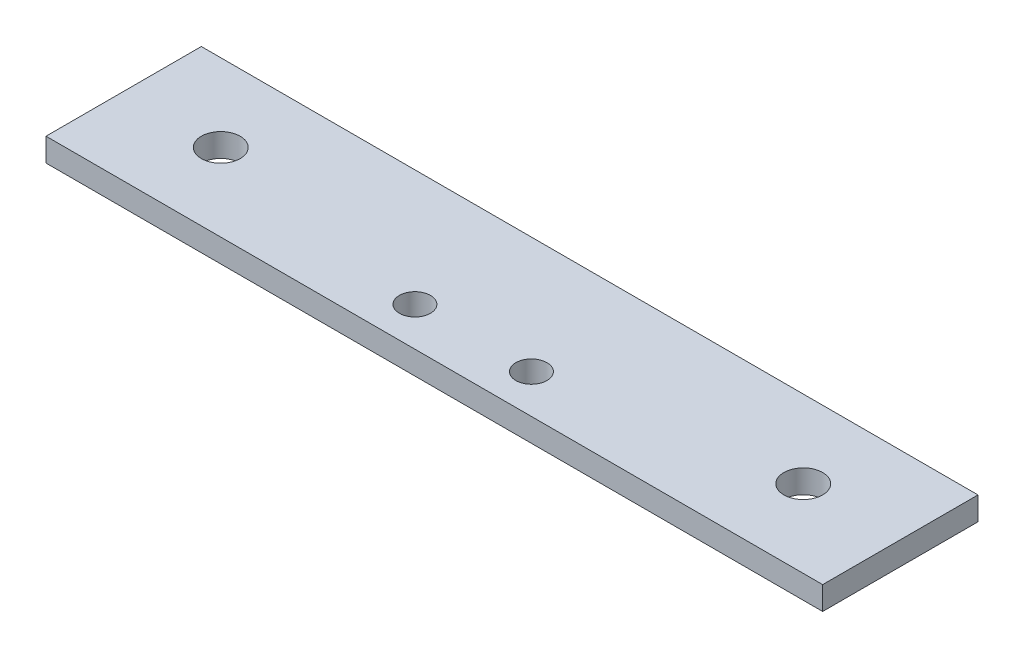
from build123d import *

# Parameters (mm, degrees)
SKETCH1_W           = 100
SKETCH1_H           = 20
SKETCH1_R           = 2.5
SKETCH1_R_2         = 2
BOSS_EXTRUDE1_DEPTH = 3


with BuildPart() as part:
    # Sketch1 → Boss-Extrude1 (new body)
    with BuildSketch(Plane(origin=(0, 0, 0), x_dir=(1, 0, 0), z_dir=(0, 1, 0))):
        Rectangle(SKETCH1_W, SKETCH1_H)
        with Locations(Location((-37.5, 0, 0), (0, 0, 270))):
            Circle(SKETCH1_R, mode=Mode.SUBTRACT)
        with Locations(Location((37.5, 0, 0), (0, 0, 270))):
            Circle(SKETCH1_R, mode=Mode.SUBTRACT)
        with Locations(Location((-7.5, -5, 0), (0, 0, 270))):
            Circle(SKETCH1_R_2, mode=Mode.SUBTRACT)
        with Locations(Location((7.5, -5, 0), (0, 0, 270))):
            Circle(SKETCH1_R_2, mode=Mode.SUBTRACT)
    extrude(amount=BOSS_EXTRUDE1_DEPTH)


solid = part.part
